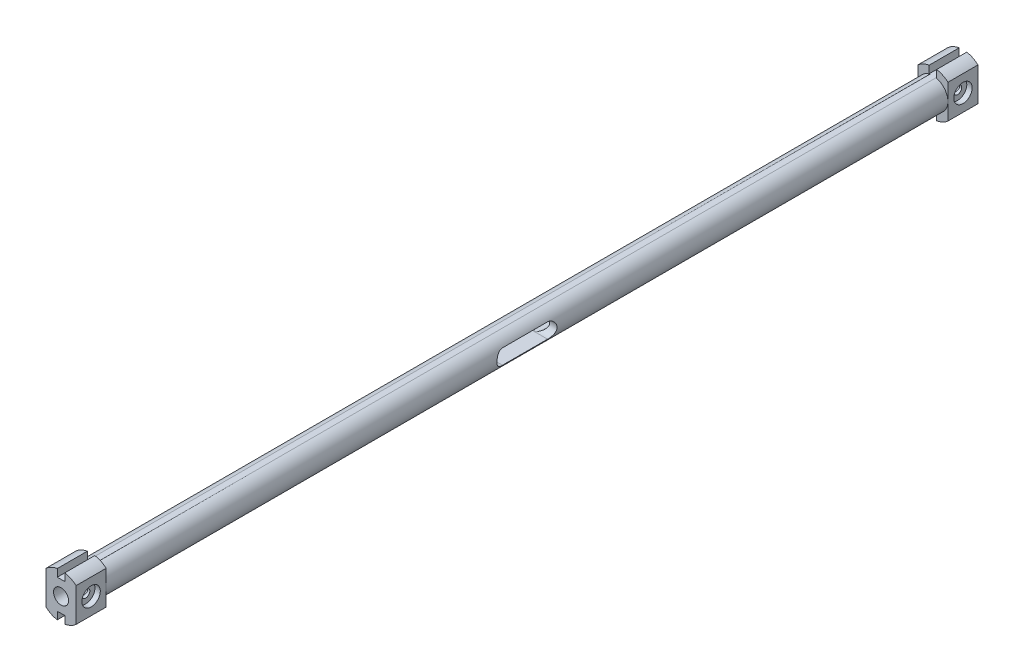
from build123d import *

# Parameters (mm, degrees)
CUT_EXTRUDE1_DEPTH                      = 301.749064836
CBORE_FOR_M5_HEX_HEAD_BOLT1_D           = 5.5
CBORE_FOR_M5_HEX_HEAD_BOLT1_CBORE_D     = 12.24
CBORE_FOR_M5_HEX_HEAD_BOLT1_CBORE_DEPTH = 3.58
CUT_EXTRUDE2_DEPTH                      = 15
SKETCH7_R                               = 5
CUT_EXTRUDE3_DEPTH                      = 601.270772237
CUT_EXTRUDE4_DEPTH                      = 601.270772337


with BuildPart() as part:
    # Sketch2 → Revolve1 (revolve)
    with BuildSketch(Plane(origin=(0, 0, 0), x_dir=(0, 0, -1), z_dir=(1, 0, 0)), mode=Mode.PRIVATE) as revolve1_sk:
        Polygon((0, 10), (-280, 10), (-280, 15), (-300, 15), (-300, 0), (0, 0), align=None)
    revolve1 = revolve(revolve1_sk.sketch.rotate(Axis((0, 0, 0), (0, 0, 1)), 90), axis=Axis((0, 0, 0), (0, 0, 1)))

    # Sketch3 → Cut-Extrude1 (cut, through all)
    with BuildSketch(Plane.XY.offset(300)):
        with BuildLine():
            Line((10, 11.180339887), (10, -11.180339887))
            ThreePointArc((10, -11.180339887), (15, 0), (10, 11.180339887))
        make_face()
        with BuildLine():
            Line((-10, 11.180339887), (-10, -11.180339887))
            ThreePointArc((-10, -11.180339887), (-15, 0), (-10, 11.180339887))
        make_face()
    cut_extrude1 = extrude(amount=-CUT_EXTRUDE1_DEPTH, mode=Mode.SUBTRACT)

    # CBORE for M5 Hex Head Bolt1 (through all)
    with Locations(Plane(origin=(10, 0, 0), x_dir=(0, 0, -1), z_dir=(1, 0, 0))):
        with Locations((-290, 0)):
            cbore_for_m5_hex_head_bolt1 = CounterBoreHole(CBORE_FOR_M5_HEX_HEAD_BOLT1_D / 2, CBORE_FOR_M5_HEX_HEAD_BOLT1_CBORE_D / 2, CBORE_FOR_M5_HEX_HEAD_BOLT1_CBORE_DEPTH)

    # Mirror1: Revolve1, Cut-Extrude1, CBORE for M5 Hex Head Bolt1 across plane
    add(revolve1.mirror(Plane(origin=(0, 10, 0), x_dir=(1, 0, 0), z_dir=(0, 0, -1))))
    add(cut_extrude1.mirror(Plane(origin=(0, 10, 0), x_dir=(1, 0, 0), z_dir=(0, 0, -1))), mode=Mode.SUBTRACT)
    add(cbore_for_m5_hex_head_bolt1.mirror(Plane(origin=(0, 10, 0), x_dir=(1, 0, 0), z_dir=(0, 0, -1))), mode=Mode.SUBTRACT)

    # Sketch6 → Cut-Extrude2 (cut, symmetric)
    with BuildSketch(Plane(origin=(0, 0, 0), x_dir=(0, 0, -1), z_dir=(1, 0, 0))):
        with BuildLine():
            Line((-15, 5), (15, 5))
            ThreePointArc((15, 5), (20, 0), (15, -5))
            Line((15, -5), (-15, -5))
            ThreePointArc((-15, -5), (-20, 0), (-15, 5))
        make_face()
    extrude(amount=CUT_EXTRUDE2_DEPTH, both=True, mode=Mode.SUBTRACT)

    # Sketch7 → Cut-Extrude3 (cut, through all)
    with BuildSketch(Plane.XY.offset(300)):
        Circle(SKETCH7_R)
    extrude(amount=-CUT_EXTRUDE3_DEPTH, mode=Mode.SUBTRACT)

    # Sketch8 → Cut-Extrude4 (cut, through all)
    with BuildSketch(Plane.XY.offset(300)):
        with BuildLine():
            Line((2.5, 14.790199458), (2.5, 9.790199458))
            Line((2.5, 9.790199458), (-2.5, 9.790199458))
            Line((-2.5, 9.790199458), (-2.5, 14.790199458))
            ThreePointArc((-2.5, 14.790199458), (0, 15), (2.5, 14.790199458))
        make_face()
        with BuildLine():
            Line((2.5, -9.790199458), (-2.5, -9.790199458))
            Line((-2.5, -9.790199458), (-2.5, -14.790199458))
            ThreePointArc((-2.5, -14.790199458), (0, -15), (2.5, -14.790199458))
            Line((2.5, -14.790199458), (2.5, -9.790199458))
        make_face()
    extrude(amount=-CUT_EXTRUDE4_DEPTH, mode=Mode.SUBTRACT)


solid = part.part
